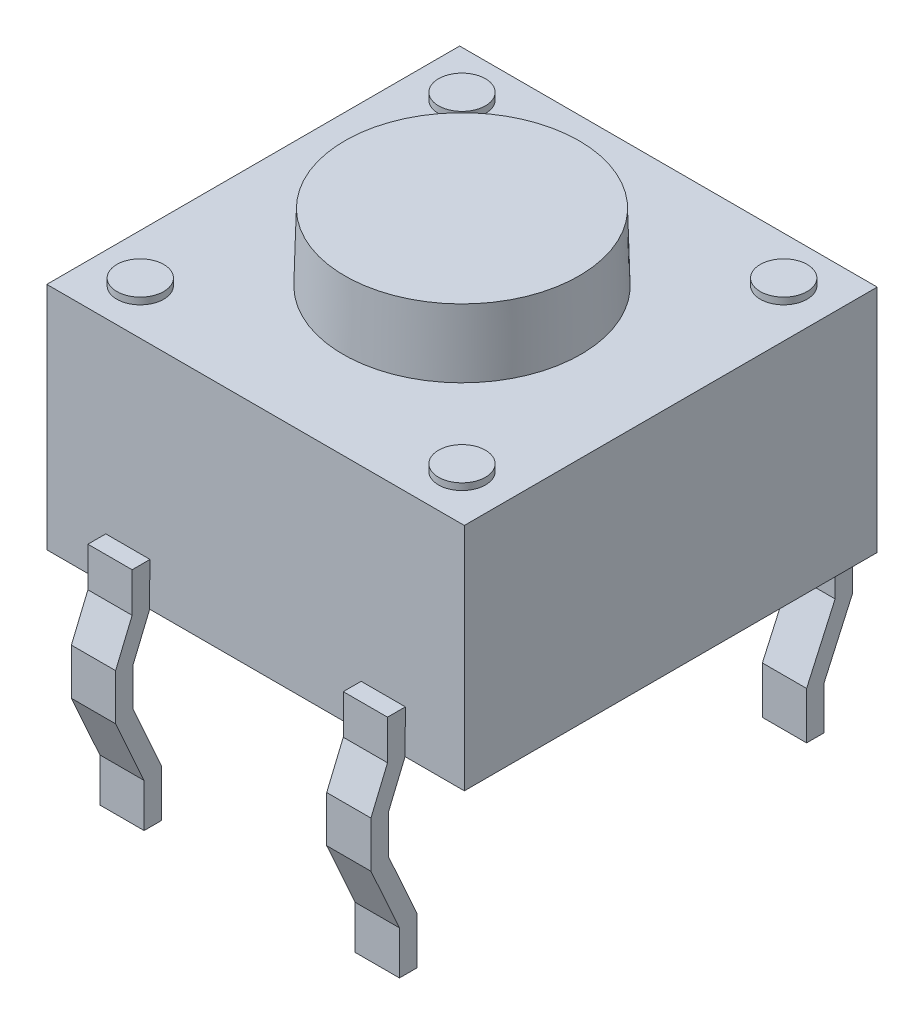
from build123d import *

# Parameters (mm, degrees)
ESQUISSE1_W               = 6.23
ESQUISSE1_H               = 6.16
EXTRUSION1_DEPTH          = 3.43
ESQUISSE3_W               = 0.66
ESQUISSE3_H               = 0.261460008
SYM_TRIE2_COPY_1_SKETCH_W = 0.66
SYM_TRIE2_COPY_1_SKETCH_H = 0.261460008
ESQUISSE5_R               = 0.35
EXTRUSION3_DEPTH          = 0.1


with BuildPart() as part:
    # Esquisse1 → Extrusion1 (new body)
    with BuildSketch(Plane(origin=(0, 0, 0), x_dir=(1, 0, 0), z_dir=(0, 1, 0))):
        Rectangle(ESQUISSE1_W, ESQUISSE1_H)
    extrude(amount=EXTRUSION1_DEPTH)

    # Balayage1: sweep along a path in Esquisse4
    with BuildLine(Plane(origin=(1.575, 0, 0), x_dir=(0, 0, -1), z_dir=(1, 0, 0))) as balayage1_path:
        Line((-2.877614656, 0.502870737), (-3.203673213, 0.502870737))
        Line((-3.203673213, 0.502870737), (-3.203673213, 0.027900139))
        Line((-3.203673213, 0.027900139), (-3.450375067, -0.563178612))
        Line((-3.450375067, -0.563178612), (-3.450375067, -1.191085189))
        Line((-3.450375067, -1.191085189), (-3.025266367, -2.135488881))
        Line((-3.025266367, -2.135488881), (-3.025266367, -2.813786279))
    # Esquisse3 → Balayage1 (sweep)
    with BuildSketch(Plane.XY.offset(3.08)):
        with Locations((1.905, 0.515156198)):
            Rectangle(ESQUISSE3_W, ESQUISSE3_H)
    balayage1 = sweep(path=balayage1_path.line, transition=Transition.RIGHT)

    # Sym_trie1: Balayage1 across plane
    add(balayage1.mirror(Plane(origin=(0, 0, 0), x_dir=(0, 0, 1), z_dir=(1, 0, 0))))

    # Sym_trie2: Balayage1 across plane
    add(balayage1.mirror(Plane.XY))

    # Sym_trie2 copy 1: sweep along a path in Sym_trie2 copy 1 path
    with BuildLine(Plane.ZY.offset(1.575)) as sym_trie2_copy_1_path:
        Line((-2.877614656, 0.502870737), (-3.203673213, 0.502870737))
        Line((-3.203673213, 0.502870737), (-3.203673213, 0.027900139))
        Line((-3.203673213, 0.027900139), (-3.450375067, -0.563178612))
        Line((-3.450375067, -0.563178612), (-3.450375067, -1.191085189))
        Line((-3.450375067, -1.191085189), (-3.025266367, -2.135488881))
        Line((-3.025266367, -2.135488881), (-3.025266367, -2.813786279))
    # Sym_trie2 copy 1 sketch → Sym_trie2 copy 1 (sweep)
    with BuildSketch(Plane(origin=(0, 0, -3.08), x_dir=(-1, 0, 0), z_dir=(0, 0, -1))):
        with Locations((1.905, 0.515156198)):
            Rectangle(SYM_TRIE2_COPY_1_SKETCH_W, SYM_TRIE2_COPY_1_SKETCH_H)
    sweep(path=sym_trie2_copy_1_path.line, transition=Transition.RIGHT)

    # Esquisse5 → Extrusion3 (add)
    with BuildSketch(Plane(origin=(0, 3.43, 0), x_dir=(-1, 0, 0), z_dir=(0, 1, 0))):
        with Locations(Location((-2.400025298, 2.400025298, 0), (0, 0, 270))):
            Circle(ESQUISSE5_R)
        with Locations(Location((-2.400025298, -2.400025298, 0), (0, 0, 270))):
            Circle(ESQUISSE5_R)
        with Locations(Location((2.400025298, -2.400025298, 0), (0, 0, 270))):
            Circle(ESQUISSE5_R)
        with Locations(Location((2.400025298, 2.400025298, 0), (0, 0, 270))):
            Circle(ESQUISSE5_R)
    extrude(amount=EXTRUSION3_DEPTH)

    # Esquisse6 → R_volution1 (revolve)
    with BuildSketch(Plane(origin=(0, 0, 0), x_dir=(0, 0, -1), z_dir=(1, 0, 0)), mode=Mode.PRIVATE) as r_volution1_sk:
        Polygon((0, 3.43), (-1.775, 3.43), (-1.7475, 4.43), (0, 4.43), align=None)
    revolve(r_volution1_sk.sketch.rotate(Axis((0, -0.917603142, 0), (0, 1, 0)), 180), axis=Axis((0, -0.917603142, 0), (0, 1, 0)))


solid = part.part
